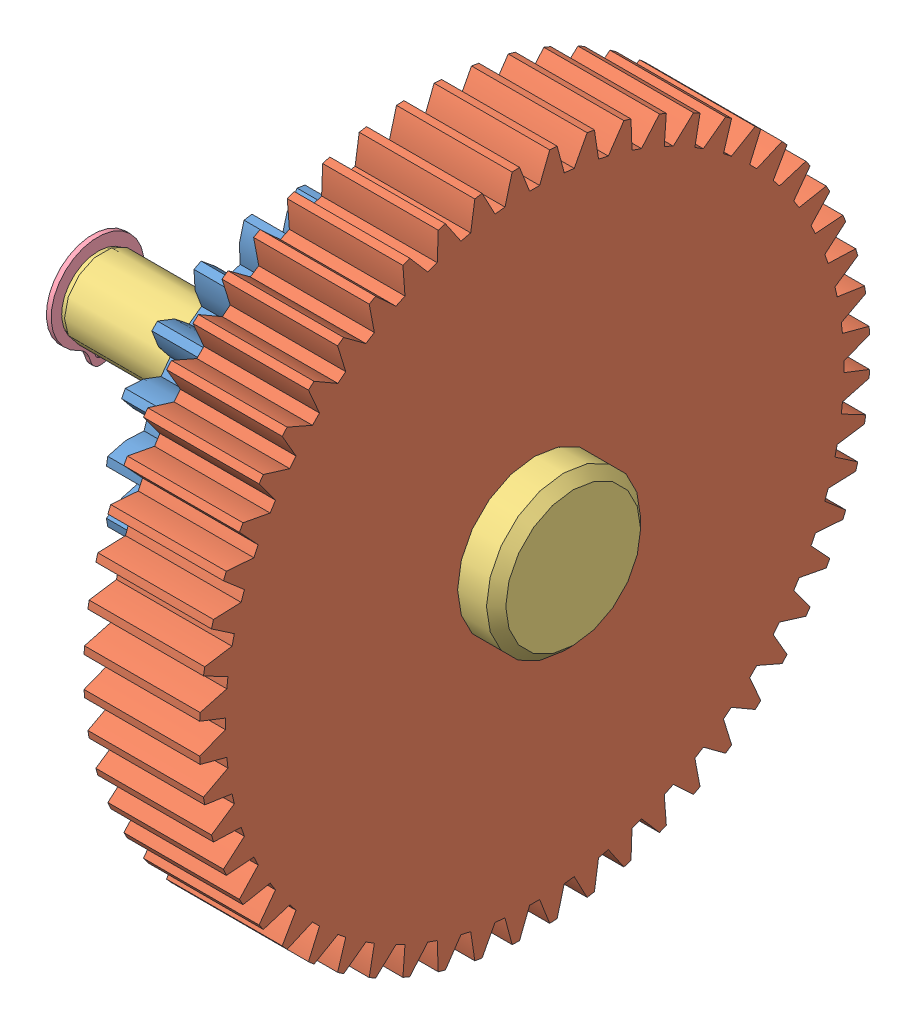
SolidWorks assembly Pignon 6et7.SLDPRT.SLDASM, configuration Défaut (file format 3400). Lengths in mm.
Overall size (25.5 34.76 34.76).
4 component instances, 4 part files, 8 mates.
Components (placement in the parent):
- Pignon 7-1: Pignon 7.SLDPRT [ISO - Spur gear 0.8M 20T 20PA 6.5FW ---S20A75H50L6.0N] at origin size (6.5 17.44 17.44)
- Pignon 6-1: Pignon 6.SLDPRT [ISO - Spur gear 0.6M 56T 20PA 6FW ---S56A75H50L6.0N] at (7.5 0 0) size (7 34.76 34.76)
- Axe pignon 6 et 7-1: Axe pignon 6 et 7.SLDPRT [Défaut] x (0 0 1) z (-1 0 0) size (8 8 25.5)
- cirlips 4-1: cirlips 4.SLDPRT [B27.7M - 3AM1-4] at (-9.4 0 0) x (0 -0.213945 0.976846) z (-1 0 0) size (4.82 5.8 0.25)
Mates (geometry in assembly coordinates):
- Coaxiale1: concentric aligned: cylinder of ?; cylinder of ?
- Coïncidente1: coincident aligned: plane of ?; plane of ?
- Coïncidente2: coincident anti-aligned: plane of ?; plane of ?
- Coaxiale3: concentric aligned: cylinder of ?; cylinder of ?
- Coïncidente4: coincident anti-aligned: plane of ?; plane of ?
- Coïncidente5: coincident anti-aligned: plane of ?; plane of ?
- Coaxiale4: concentric: cylinder of ?; cylinder of ?
- Coïncidente6: coincident anti-aligned: plane of ?; plane of ?
